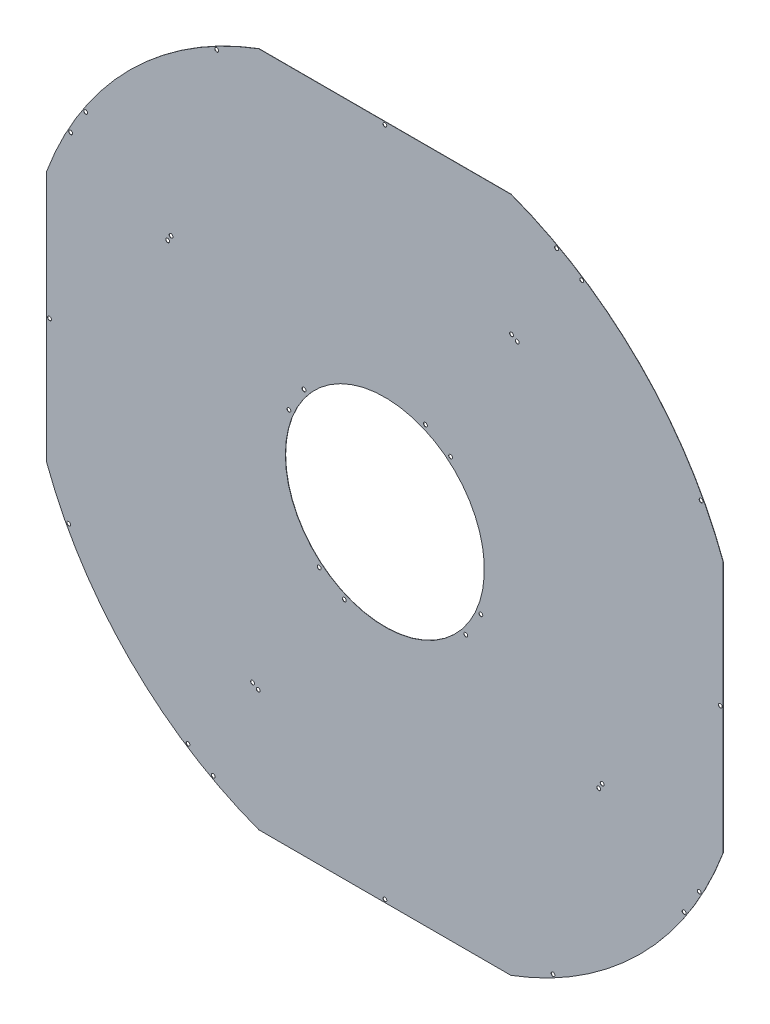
from build123d import *

# Parameters (mm, degrees)
EXTRUDE1_DEPTH     = 0.25
SKETCH2_R          = 2
CUT_EXTRUDE2_DEPTH = 484.842994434
CIRPATTERN1_COUNT  = 4


with BuildPart() as part:
    # Sketch1 → Extrude1 (new body)
    with BuildSketch(Plane.XY):
        with BuildLine():
            Line((133.086438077, 357), (-133.086438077, 357))
            ThreePointArc((-133.086438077, 357), (-243.485660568, 293.04561607), (-326.580741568, 196.229506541))
            Line((-326.580741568, 196.229506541), (-90.002566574, 54.078997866))
            ThreePointArc((-90.002566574, 54.078997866), (-25.401799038, 101.881051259), (54.078997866, 90.002566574))
            Line((54.078997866, 90.002566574), (196.229506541, 326.580741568))
            ThreePointArc((196.229506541, 326.580741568), (165.358944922, 343.245421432), (133.086438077, 357))
        make_face()
    extrude1 = extrude(amount=EXTRUDE1_DEPTH)

    # Sketch2 → Cut-Extrude2 (cut, through all)
    with BuildSketch(Plane.XY.offset(0.25)):
        with Locations((-315.753634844, 207.806742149)):
            Circle(SKETCH2_R)
        with Locations((-177.460250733, 333.754190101)):
            Circle(SKETCH2_R)
        with Locations((-85.364554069, 69.375016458)):
            Circle(SKETCH2_R)
        with Locations((0, 354)):
            Circle(SKETCH2_R)
        with Locations((42.802830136, 101.330734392)):
            Circle(SKETCH2_R)
        with Locations((181.234555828, 331.719815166)):
            Circle(SKETCH2_R)
        with Locations((133.694585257, 229.300769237)):
            Circle(SKETCH2_R)
        with Locations((-225.695502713, 139.694756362)):
            Circle(SKETCH2_R)
    cut_extrude2 = extrude(amount=-CUT_EXTRUDE2_DEPTH, mode=Mode.SUBTRACT)

    # CirPattern1: Extrude1, Cut-Extrude2 ×4 about axis
    cirpattern1_axis = Axis((0, 0, 0), (0, 0, 1))
    add([extrude1.rotate(cirpattern1_axis, i * 360 / CIRPATTERN1_COUNT) for i in range(1, CIRPATTERN1_COUNT)])
    add([cut_extrude2.rotate(cirpattern1_axis, i * 360 / CIRPATTERN1_COUNT) for i in range(1, CIRPATTERN1_COUNT)], mode=Mode.SUBTRACT)


solid = part.part
